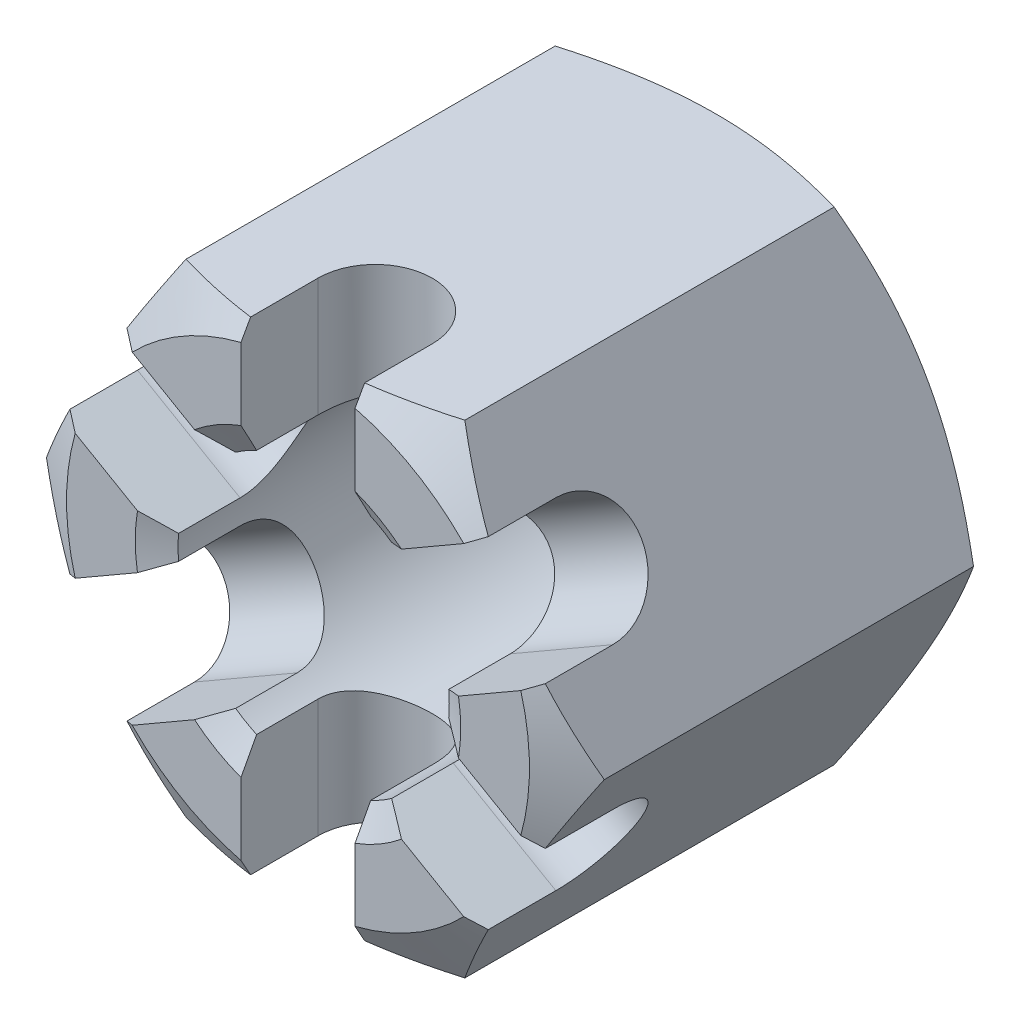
from build123d import *
from OCP.BRepFilletAPI import BRepFilletAPI_MakeChamfer

# Parameters (mm, degrees)
SKETCH1_R         = 5.053
BASENUT_DEPTH     = 15.8
ENDCHAMFER_SIZE   = 1.0106
ENDCHAMFER_SIZE2  = 0.583470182
SLOT_DEPTH        = 21.943734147
SLOTPATTERN_COUNT = 3


with BuildPart() as part:
    # Sketch1 → BaseNut (new body)
    with BuildSketch(Plane.XY):
        Polygon((5.196152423, -9), (10.392304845, 0), (5.196152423, 9), (-5.196152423, 9), (-10.392304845, 0), (-5.196152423, -9), align=None)
        Circle(SKETCH1_R, mode=Mode.SUBTRACT)
    extrude(amount=-BASENUT_DEPTH)

    # Sketch2 → Double-Chamfer (revolve, cut)
    with BuildSketch(Plane(origin=(0, 0, 0), x_dir=(1, 0, 0), z_dir=(0, 1, 0))):
        Polygon((-10.392304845, 15.8), (-8.625, 15.8), (-10.392304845, 14.779646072), align=None)
        Polygon((-10.392304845, 1.020353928), (-10.392304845, 0), (-8.625, 0), align=None)
    revolve(axis=Axis((0, 0, -3.375940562), (0, 0, 1)), mode=Mode.SUBTRACT)

    # EndChamfer: one chamfer whose edges measure the first distance from different faces: ONE call of the kernel's chamfer builder (chamfer() names one face for all edges)
    endchamfer_edges_1 = [part.edges().sort_by_distance(p)[0] for p in [
        (-5.053, 0, -15.8),
    ]]
    endchamfer_side_1 = [part.faces().sort_by_distance(p)[0] for p in [
        (-5.053, 0, -7.9),
    ]]
    endchamfer_edges_2 = [part.edges().sort_by_distance(p)[0] for p in [
        (-5.053, 0, 0),
    ]]
    endchamfer_side_2 = [part.faces().sort_by_distance(p)[0] for p in [
        (8.38104816, 0, 0),
    ]]
    endchamfer = BRepFilletAPI_MakeChamfer(part.part.solid().wrapped)
    for e in endchamfer_edges_1:
        endchamfer.Add(ENDCHAMFER_SIZE, ENDCHAMFER_SIZE2, e.wrapped, endchamfer_side_1[0].wrapped)  # the first distance lies on this face
    for e in endchamfer_edges_2:
        endchamfer.Add(ENDCHAMFER_SIZE, ENDCHAMFER_SIZE2, e.wrapped, endchamfer_side_2[0].wrapped)  # the first distance lies on this face
    add(Compound.cast(endchamfer.Shape()), mode=Mode.REPLACE)

    # Sketch3 → Slot (cut, symmetric)
    with BuildSketch(Plane(origin=(0, 0, 0), x_dir=(1, 0, 0), z_dir=(0, 1, 0))):
        with BuildLine():
            Line((-2.125, -50.314906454), (-2.125, 0))
            Line((-2.125, 0), (-2.125, 2.875))
            ThreePointArc((-2.125, 2.875), (0, 5), (2.125, 2.875))
            Line((2.125, 2.875), (2.125, 0))
            Line((2.125, 0), (2.125, -50.314906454))
            Line((2.125, -50.314906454), (2.125, -150.944719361))
            Line((2.125, -150.944719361), (-2.125, -150.944719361))
            Line((-2.125, -150.944719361), (-2.125, -50.314906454))
        make_face()
    slot = extrude(amount=SLOT_DEPTH, both=True, mode=Mode.SUBTRACT)

    # SlotPattern: Slot ×3 about axis
    slotpattern_axis = Axis((0, 0, -3.375940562), (0, 0, 1))
    for i in range(1, SLOTPATTERN_COUNT):
        add(slot.rotate(slotpattern_axis, i * 360 / SLOTPATTERN_COUNT), mode=Mode.SUBTRACT)


solid = part.part
